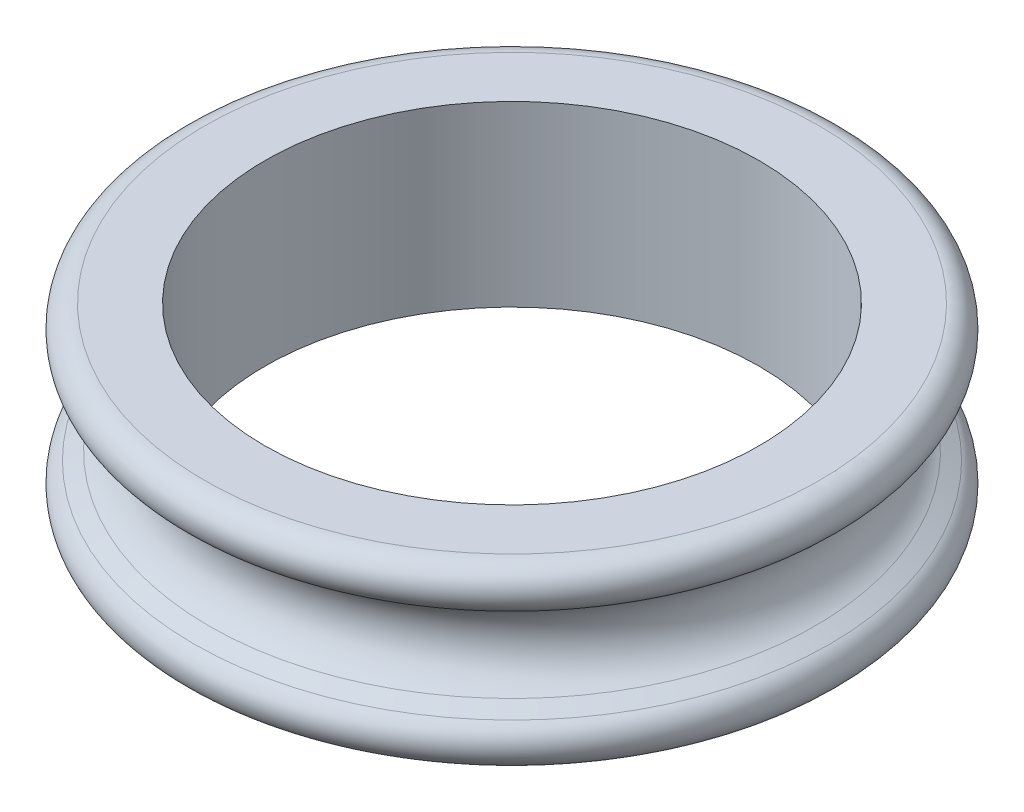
from build123d import *

# Parameters (mm, degrees)
SKETCH1_R           = 12.5
SKETCH1_R_2         = 11.1
BOSS_EXTRUDE1_DEPTH = 8


with BuildPart() as part:
    # Sketch1 → Boss-Extrude1 (new body)
    with BuildSketch(Plane(origin=(0, 0, 0), x_dir=(1, 0, 0), z_dir=(0, 1, 0))):
        with Locations(Location((0, 0, 0), (0, 0, 270))):
            Circle(SKETCH1_R)
        with Locations(Location((0, 0, 0), (0, 0, 270))):
            Circle(SKETCH1_R_2, mode=Mode.SUBTRACT)
    extrude(amount=BOSS_EXTRUDE1_DEPTH)

    # Sketch2 → Revolve1 (revolve)
    with BuildSketch(Plane(origin=(0, 0, 0), x_dir=(0, 0, -1), z_dir=(1, 0, 0))):
        with BuildLine():
            Line((12.5, 8), (13.801211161, 8))
            ThreePointArc((13.801211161, 8), (14.770229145, 7.246990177), (14.279887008, 6.122008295))
            Line((14.279887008, 6.122008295), (13.608520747, 5.75598341))
            ThreePointArc((13.608520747, 5.75598341), (12.565872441, 4), (13.608520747, 2.24401659))
            Line((13.608520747, 2.24401659), (14.279887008, 1.877991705))
            ThreePointArc((14.279887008, 1.877991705), (14.770229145, 0.753009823), (13.801211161, 0))
            Line((13.801211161, 0), (12.5, 0))
            Line((12.5, 0), (12.5, 8))
        make_face()
    revolve(axis=Axis((0, 0, 0), (0, 1, 0)))


solid = part.part
